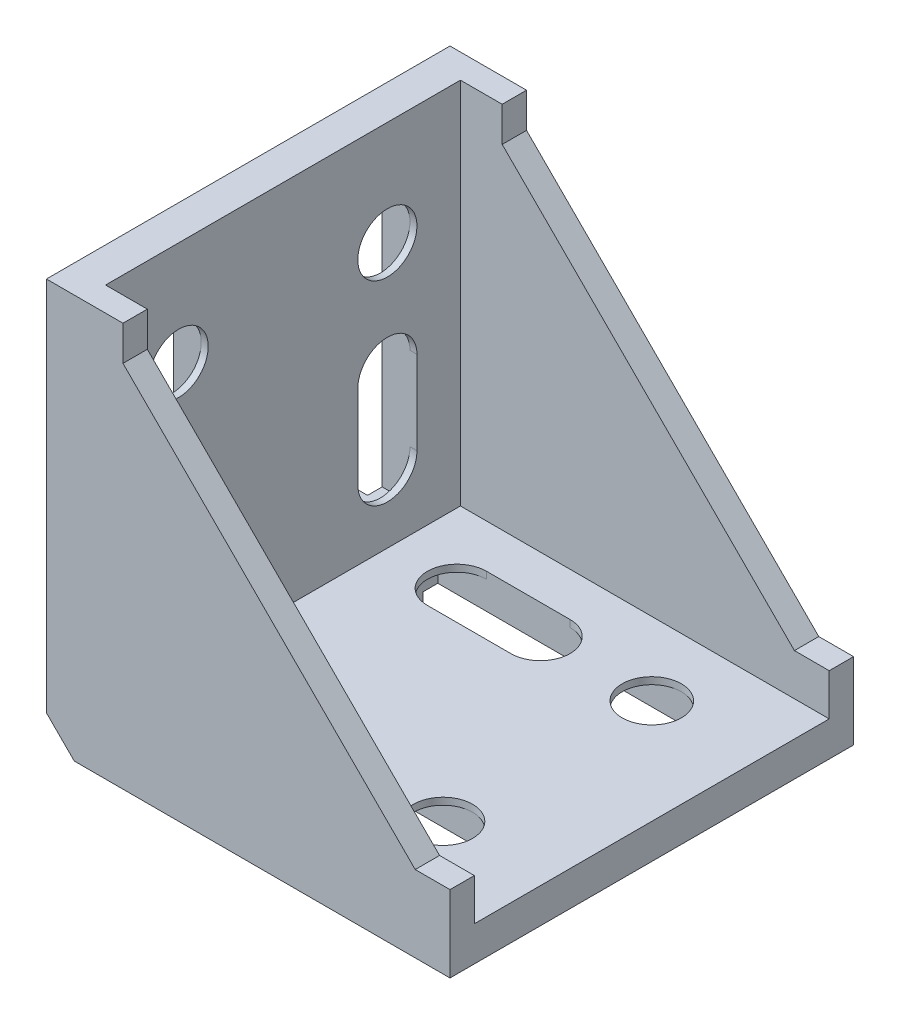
from build123d import *

# Parameters (mm, degrees)
EXTRUDE_1_DEPTH      = 29
EXTRUDE_1_DEPTH_BACK = 29
EXTRUDE_3_DEPTH      = 3.5
EXTRUDE_4_DEPTH      = 3.5
SKETCH_14_R          = 4.25
CUT_EXTRUDE_3_DEPTH  = 88
SKETCH_18_W          = 4
SKETCH_18_H          = 49.5
CUT_EXTRUDE_5_DEPTH  = 4
EXTRUDE_6_DEPTH      = 2
CUT_EXTRUDE_6_DEPTH  = 4
CHAMFER_1_SIZE       = 4


with BuildPart() as part:
    # Sketch 1 → Extrude 1 (new, two sides: drawn at the far end of the back side and taken through both)
    with BuildSketch(Plane.XY.offset(-EXTRUDE_1_DEPTH_BACK)):
        Polygon((0, 58), (5, 58), (5, 5), (58, 5), (58, 0), (0, 0), align=None)
    extrude(amount=EXTRUDE_1_DEPTH + EXTRUDE_1_DEPTH_BACK)

    # Sketch 3 → Extrude 3 (add)
    with BuildSketch(Plane.XY.offset(29)):
        Polygon((5, 58), (11, 58), (11, 53), (53, 11), (58, 11), (58, 5), (5, 5), align=None)
    extrude(amount=-EXTRUDE_3_DEPTH)

    # Sketch 6 → Extrude 4 (add)
    with BuildSketch(Plane(origin=(0, 0, -29), x_dir=(-1, 0, 0), z_dir=(0, 0, -1))):
        Polygon((-5, 58), (-11, 58), (-11, 53), (-53, 11), (-58, 11), (-58, 5), (-5, 5), align=None)
    extrude(amount=-EXTRUDE_4_DEPTH)

    # Sketch 14 → Cut-Extrude 3 (cut, through all)
    with BuildSketch(Plane.ZY):
        with Locations((-15, 43)):
            Circle(SKETCH_14_R)
        with Locations((15, 43)):
            Circle(SKETCH_14_R)
        with BuildLine():
            Line((10.75, 27), (10.75, 15))
            ThreePointArc((10.75, 15), (15, 10.75), (19.25, 15))
            Line((19.25, 15), (19.25, 27))
            ThreePointArc((19.25, 27), (15, 31.25), (10.75, 27))
        make_face()
        with BuildLine():
            Line((-10.75, 27), (-10.75, 15))
            ThreePointArc((-10.75, 15), (-15, 10.75), (-19.25, 15))
            Line((-19.25, 15), (-19.25, 27))
            ThreePointArc((-19.25, 27), (-15, 31.25), (-10.75, 27))
        make_face()
    cut_extrude_3 = extrude(amount=-CUT_EXTRUDE_3_DEPTH, mode=Mode.SUBTRACT)

    # Sketch 18 → Cut-Extrude 5 (cut)
    with BuildSketch(Plane.ZY):
        with Locations((-23.73840159, 29.75)):
            Rectangle(SKETCH_18_W, SKETCH_18_H)
        Polygon((-19.25, 43), (-19.25, 52), (-10.75, 52), (-10.75, 8), (-19.25, 8), align=None)
        Polygon((19.25, 43), (19.25, 8), (10.75, 8), (10.75, 52), (19.25, 52), align=None)
        with Locations((23.73840159, 29.75)):
            Rectangle(SKETCH_18_W, SKETCH_18_H)
    cut_extrude_5 = extrude(amount=-CUT_EXTRUDE_5_DEPTH, mode=Mode.SUBTRACT)

    # Sketch 19 → Extrude 6 (add)
    with BuildSketch(Plane.ZY):
        Polygon((-15, 52), (-12.5, 52), (-12.5, 54), (-17.5, 54), (-17.5, 52), align=None)
        Polygon((-15, 8), (-12.151822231, 8), (-12.151822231, 6), (-17.151822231, 6), (-17.151822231, 8), align=None)
        Polygon((17.151822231, 8), (15, 8), (12.151822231, 8), (12.151822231, 6), (17.151822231, 6), align=None)
        Polygon((17.5, 52), (15, 52), (12.5, 52), (12.5, 54), (17.5, 54), align=None)
    extrude_6 = extrude(amount=EXTRUDE_6_DEPTH)

    # Sketch 20 → Cut-Extrude 6 (cut)
    with BuildSketch(Plane.ZY):
        Polygon((0, 54.5), (8, 54.5), (8, 5.687531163), (-8, 5.687531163), (-8, 54.5), align=None)
    cut_extrude_6 = extrude(amount=-CUT_EXTRUDE_6_DEPTH, mode=Mode.SUBTRACT)

    # Mirror 5: Cut-Extrude 6 across plane
    add(cut_extrude_6.mirror(Plane(origin=(0, 0, 0), x_dir=(0, 0, 1), z_dir=(0.7071067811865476, -0.7071067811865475, 0))), mode=Mode.SUBTRACT)

    # Mirror 6: Cut-Extrude 5 across plane
    add(cut_extrude_5.mirror(Plane(origin=(0, 0, 0), x_dir=(0, 0, 1), z_dir=(0.7071067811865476, -0.7071067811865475, 0))), mode=Mode.SUBTRACT)

    # Mirror 7: Extrude 6 across plane
    add(extrude_6.mirror(Plane(origin=(0, 0, 0), x_dir=(0, 0, 1), z_dir=(0.7071067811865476, -0.7071067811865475, 0))))

    # Mirror 8: Cut-Extrude 3 across plane
    add(cut_extrude_3.mirror(Plane(origin=(0, 0, 0), x_dir=(0, 0, 1), z_dir=(0.7071067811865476, -0.7071067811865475, 0))), mode=Mode.SUBTRACT)

    # Chamfer 1
    chamfer_1_edges = [part.edges().sort_by_distance(p)[0] for p in [
        (0, 0, 0),
    ]]
    chamfer(chamfer_1_edges, length=CHAMFER_1_SIZE)


solid = part.part
